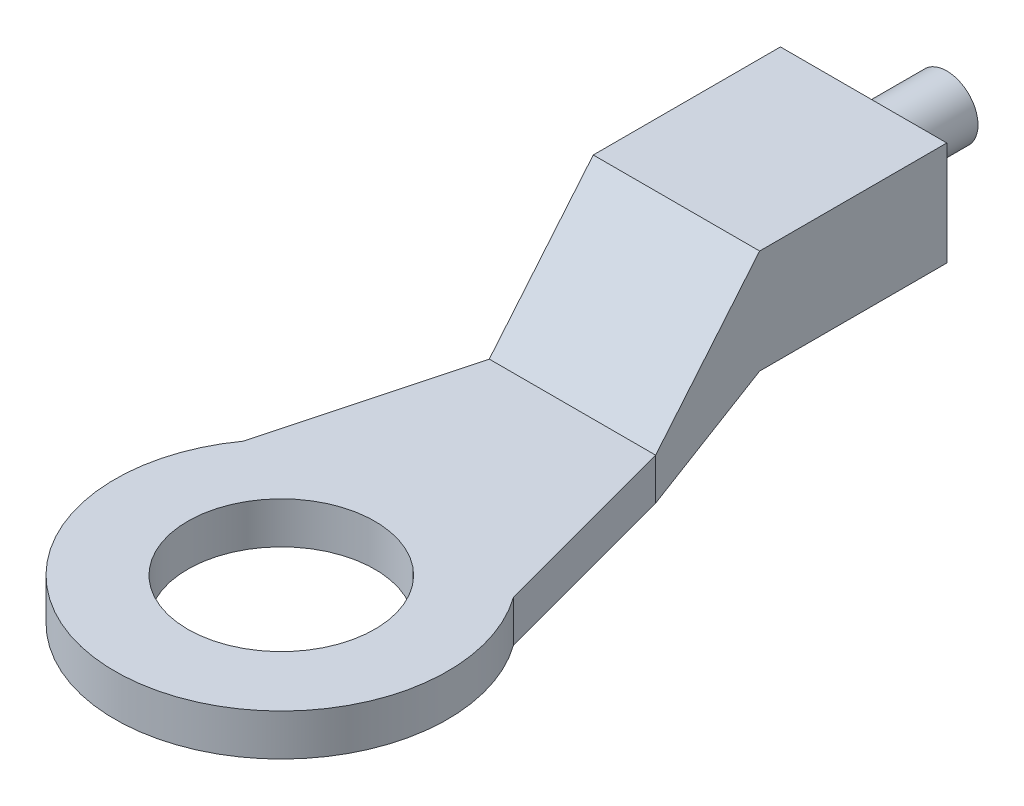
ISO-10303-21;
HEADER;
FILE_DESCRIPTION(('STEP AP214'),'2;1');
FILE_NAME('part.step','',(''),(''),'','','');
FILE_SCHEMA(('AUTOMOTIVE_DESIGN { 1 0 10303 214 1 1 1 1 }'));
ENDSEC;
DATA;
#1=APPLICATION_CONTEXT('core data for automotive mechanical design processes');
#2=APPLICATION_PROTOCOL_DEFINITION('international standard','automotive_design',2000,#1);
#3=PRODUCT_CONTEXT('',#1,'mechanical');
#4=PRODUCT('Part','Part','',(#3));
#5=PRODUCT_RELATED_PRODUCT_CATEGORY('part','',(#4));
#6=PRODUCT_DEFINITION_FORMATION('','',#4);
#7=PRODUCT_DEFINITION_CONTEXT('part definition',#1,'design');
#8=PRODUCT_DEFINITION('design','',#6,#7);
#9=PRODUCT_DEFINITION_SHAPE('','',#8);
#10=(LENGTH_UNIT() NAMED_UNIT(*) SI_UNIT(.MILLI.,.METRE.));
#11=(NAMED_UNIT(*) PLANE_ANGLE_UNIT() SI_UNIT($,.RADIAN.));
#12=(NAMED_UNIT(*) SI_UNIT($,.STERADIAN.) SOLID_ANGLE_UNIT());
#13=UNCERTAINTY_MEASURE_WITH_UNIT(LENGTH_MEASURE(1.E-05),#10,'distance_accuracy_value','');
#14=(GEOMETRIC_REPRESENTATION_CONTEXT(3) GLOBAL_UNCERTAINTY_ASSIGNED_CONTEXT((#13)) GLOBAL_UNIT_ASSIGNED_CONTEXT((#10,
#11,#12)) REPRESENTATION_CONTEXT('',''));
#15=CARTESIAN_POINT('',(0.,0.,0.));
#16=DIRECTION('',(0.,0.,1.));
#17=DIRECTION('',(1.,0.,0.));
#18=AXIS2_PLACEMENT_3D('',#15,#16,#17);
#19=CARTESIAN_POINT('',(2.,4.,-14.));
#20=DIRECTION('',(0.,0.,1.));
#21=DIRECTION('',(1.,0.,0.));
#22=AXIS2_PLACEMENT_3D('',#19,#20,#21);
#23=PLANE('',#22);
#24=DIRECTION('',(-1.,0.,0.));
#25=VECTOR('',#24,1.);
#26=CARTESIAN_POINT('',(2.,1.5,-14.));
#27=LINE('',#26,#25);
#28=CARTESIAN_POINT('',(2.,1.5,-14.));
#29=VERTEX_POINT('',#28);
#30=CARTESIAN_POINT('',(-2.,1.5,-14.));
#31=VERTEX_POINT('',#30);
#32=EDGE_CURVE('E103',#29,#31,#27,.T.);
#33=ORIENTED_EDGE('',*,*,#32,.T.);
#34=DIRECTION('',(0.,1.,0.));
#35=VECTOR('',#34,1.);
#36=CARTESIAN_POINT('',(-2.,4.,-14.));
#37=LINE('',#36,#35);
#38=CARTESIAN_POINT('',(-2.,4.,-14.));
#39=VERTEX_POINT('',#38);
#40=EDGE_CURVE('E113',#31,#39,#37,.T.);
#41=ORIENTED_EDGE('',*,*,#40,.T.);
#42=DIRECTION('',(-1.,0.,0.));
#43=VECTOR('',#42,1.);
#44=CARTESIAN_POINT('',(2.,4.,-14.));
#45=LINE('',#44,#43);
#46=CARTESIAN_POINT('',(2.,4.,-14.));
#47=VERTEX_POINT('',#46);
#48=EDGE_CURVE('E142',#47,#39,#45,.T.);
#49=ORIENTED_EDGE('',*,*,#48,.F.);
#50=DIRECTION('',(0.,1.,0.));
#51=VECTOR('',#50,1.);
#52=CARTESIAN_POINT('',(2.,4.,-14.));
#53=LINE('',#52,#51);
#54=EDGE_CURVE('E133',#29,#47,#53,.T.);
#55=ORIENTED_EDGE('',*,*,#54,.F.);
#56=EDGE_LOOP('',(#33,#41,#49,#55));
#57=FACE_BOUND('',#56,.T.);
#58=CARTESIAN_POINT('',(0.,2.75,-14.));
#59=DIRECTION('',(0.,0.,1.));
#60=DIRECTION('',(1.,0.,0.));
#61=AXIS2_PLACEMENT_3D('',#58,#59,#60);
#62=CIRCLE('',#61,0.75);
#63=CARTESIAN_POINT('',(0.75,2.75,-14.));
#64=VERTEX_POINT('',#63);
#65=EDGE_CURVE('E11',#64,#64,#62,.F.);
#66=ORIENTED_EDGE('',*,*,#65,.F.);
#67=EDGE_LOOP('',(#66));
#68=FACE_BOUND('',#67,.T.);
#69=ADVANCED_FACE('F28',(#57,#68),#23,.F.);
#70=CARTESIAN_POINT('',(0.,1.,0.));
#71=DIRECTION('',(0.,1.,0.));
#72=DIRECTION('',(0.,0.,1.));
#73=AXIS2_PLACEMENT_3D('',#70,#71,#72);
#74=PLANE('',#73);
#75=CARTESIAN_POINT('',(0.,1.,0.));
#76=DIRECTION('',(0.,1.,0.));
#77=DIRECTION('',(0.,0.,1.));
#78=AXIS2_PLACEMENT_3D('',#75,#76,#77);
#79=CIRCLE('',#78,4.);
#80=CARTESIAN_POINT('',(-3.25,1.,-2.3318447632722));
#81=VERTEX_POINT('',#80);
#82=CARTESIAN_POINT('',(3.25,1.,-2.3318447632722));
#83=VERTEX_POINT('',#82);
#84=EDGE_CURVE('E159',#81,#83,#79,.T.);
#85=ORIENTED_EDGE('',*,*,#84,.T.);
#86=DIRECTION('',(-0.258659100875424,0.,-0.96596866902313));
#87=VECTOR('',#86,1.);
#88=CARTESIAN_POINT('',(2.,1.,-7.));
#89=LINE('',#88,#87);
#90=CARTESIAN_POINT('',(2.,1.,-7.));
#91=VERTEX_POINT('',#90);
#92=EDGE_CURVE('E161',#83,#91,#89,.T.);
#93=ORIENTED_EDGE('',*,*,#92,.T.);
#94=DIRECTION('',(-1.,0.,0.));
#95=VECTOR('',#94,1.);
#96=CARTESIAN_POINT('',(-2.,1.,-7.));
#97=LINE('',#96,#95);
#98=CARTESIAN_POINT('',(-2.,1.,-7.));
#99=VERTEX_POINT('',#98);
#100=EDGE_CURVE('E48',#91,#99,#97,.T.);
#101=ORIENTED_EDGE('',*,*,#100,.T.);
#102=DIRECTION('',(-0.258659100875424,0.,0.96596866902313));
#103=VECTOR('',#102,1.);
#104=CARTESIAN_POINT('',(-3.25,1.,-2.3318447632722));
#105=LINE('',#104,#103);
#106=EDGE_CURVE('E43',#99,#81,#105,.T.);
#107=ORIENTED_EDGE('',*,*,#106,.T.);
#108=EDGE_LOOP('',(#85,#93,#101,#107));
#109=FACE_BOUND('',#108,.T.);
#110=CARTESIAN_POINT('',(0.,1.,0.));
#111=DIRECTION('',(0.,1.,0.));
#112=DIRECTION('',(0.,0.,1.));
#113=AXIS2_PLACEMENT_3D('',#110,#111,#112);
#114=CIRCLE('',#113,2.25);
#115=CARTESIAN_POINT('',(0.,1.,2.25));
#116=VERTEX_POINT('',#115);
#117=EDGE_CURVE('E147',#116,#116,#114,.T.);
#118=ORIENTED_EDGE('',*,*,#117,.F.);
#119=EDGE_LOOP('',(#118));
#120=FACE_BOUND('',#119,.T.);
#121=ADVANCED_FACE('F210',(#109,#120),#74,.T.);
#122=CARTESIAN_POINT('',(0.,0.,0.));
#123=DIRECTION('',(0.,1.,0.));
#124=DIRECTION('',(0.,0.,1.));
#125=AXIS2_PLACEMENT_3D('',#122,#123,#124);
#126=PLANE('',#125);
#127=CARTESIAN_POINT('',(0.,0.,0.));
#128=DIRECTION('',(0.,1.,0.));
#129=DIRECTION('',(0.,0.,1.));
#130=AXIS2_PLACEMENT_3D('',#127,#128,#129);
#131=CIRCLE('',#130,4.);
#132=CARTESIAN_POINT('',(-3.25,0.,-2.3318447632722));
#133=VERTEX_POINT('',#132);
#134=CARTESIAN_POINT('',(3.25,0.,-2.3318447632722));
#135=VERTEX_POINT('',#134);
#136=EDGE_CURVE('E150',#133,#135,#131,.T.);
#137=ORIENTED_EDGE('',*,*,#136,.F.);
#138=DIRECTION('',(-0.258659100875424,0.,0.96596866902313));
#139=VECTOR('',#138,1.);
#140=CARTESIAN_POINT('',(-3.25,0.,-2.3318447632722));
#141=LINE('',#140,#139);
#142=CARTESIAN_POINT('',(-2.,0.,-7.));
#143=VERTEX_POINT('',#142);
#144=EDGE_CURVE('E157',#143,#133,#141,.T.);
#145=ORIENTED_EDGE('',*,*,#144,.F.);
#146=DIRECTION('',(-1.,0.,0.));
#147=VECTOR('',#146,1.);
#148=CARTESIAN_POINT('',(-2.,0.,-7.));
#149=LINE('',#148,#147);
#150=CARTESIAN_POINT('',(2.,0.,-7.));
#151=VERTEX_POINT('',#150);
#152=EDGE_CURVE('E117',#151,#143,#149,.T.);
#153=ORIENTED_EDGE('',*,*,#152,.F.);
#154=DIRECTION('',(-0.258659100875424,0.,-0.96596866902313));
#155=VECTOR('',#154,1.);
#156=CARTESIAN_POINT('',(2.,0.,-7.));
#157=LINE('',#156,#155);
#158=EDGE_CURVE('E153',#135,#151,#157,.T.);
#159=ORIENTED_EDGE('',*,*,#158,.F.);
#160=EDGE_LOOP('',(#137,#145,#153,#159));
#161=FACE_BOUND('',#160,.T.);
#162=CARTESIAN_POINT('',(0.,0.,0.));
#163=DIRECTION('',(0.,1.,0.));
#164=DIRECTION('',(0.,0.,1.));
#165=AXIS2_PLACEMENT_3D('',#162,#163,#164);
#166=CIRCLE('',#165,2.25);
#167=CARTESIAN_POINT('',(0.,0.,2.25));
#168=VERTEX_POINT('',#167);
#169=EDGE_CURVE('E102',#168,#168,#166,.T.);
#170=ORIENTED_EDGE('',*,*,#169,.T.);
#171=EDGE_LOOP('',(#170));
#172=FACE_BOUND('',#171,.T.);
#173=ADVANCED_FACE('F182',(#161,#172),#126,.F.);
#174=CARTESIAN_POINT('',(0.,1.,0.));
#175=DIRECTION('',(0.,-1.,0.));
#176=DIRECTION('',(0.,0.,-1.));
#177=AXIS2_PLACEMENT_3D('',#174,#175,#176);
#178=CYLINDRICAL_SURFACE('',#177,4.);
#179=ORIENTED_EDGE('',*,*,#136,.T.);
#180=DIRECTION('',(0.,-1.,0.));
#181=VECTOR('',#180,1.);
#182=CARTESIAN_POINT('',(3.25,1.,-2.3318447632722));
#183=LINE('',#182,#181);
#184=EDGE_CURVE('E36',#83,#135,#183,.T.);
#185=ORIENTED_EDGE('',*,*,#184,.F.);
#186=ORIENTED_EDGE('',*,*,#84,.F.);
#187=DIRECTION('',(0.,-1.,0.));
#188=VECTOR('',#187,1.);
#189=CARTESIAN_POINT('',(-3.25,1.,-2.3318447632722));
#190=LINE('',#189,#188);
#191=EDGE_CURVE('E165',#81,#133,#190,.T.);
#192=ORIENTED_EDGE('',*,*,#191,.T.);
#193=EDGE_LOOP('',(#179,#185,#186,#192));
#194=FACE_BOUND('',#193,.T.);
#195=ADVANCED_FACE('F30',(#194),#178,.T.);
#196=CARTESIAN_POINT('',(2.,1.,-7.));
#197=DIRECTION('',(-0.96596866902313,0.,0.258659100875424));
#198=DIRECTION('',(0.258659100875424,0.,0.96596866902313));
#199=AXIS2_PLACEMENT_3D('',#196,#197,#198);
#200=PLANE('',#199);
#201=ORIENTED_EDGE('',*,*,#158,.T.);
#202=DIRECTION('',(0.,-1.,0.));
#203=VECTOR('',#202,1.);
#204=CARTESIAN_POINT('',(2.,1.,-7.));
#205=LINE('',#204,#203);
#206=EDGE_CURVE('E170',#91,#151,#205,.T.);
#207=ORIENTED_EDGE('',*,*,#206,.F.);
#208=ORIENTED_EDGE('',*,*,#92,.F.);
#209=ORIENTED_EDGE('',*,*,#184,.T.);
#210=EDGE_LOOP('',(#201,#207,#208,#209));
#211=FACE_BOUND('',#210,.T.);
#212=ADVANCED_FACE('F175',(#211),#200,.F.);
#213=CARTESIAN_POINT('',(-3.25,1.,-2.3318447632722));
#214=DIRECTION('',(0.96596866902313,0.,0.258659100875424));
#215=DIRECTION('',(0.258659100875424,0.,-0.96596866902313));
#216=AXIS2_PLACEMENT_3D('',#213,#214,#215);
#217=PLANE('',#216);
#218=ORIENTED_EDGE('',*,*,#144,.T.);
#219=ORIENTED_EDGE('',*,*,#191,.F.);
#220=ORIENTED_EDGE('',*,*,#106,.F.);
#221=DIRECTION('',(0.,-1.,0.));
#222=VECTOR('',#221,1.);
#223=CARTESIAN_POINT('',(-2.,1.,-7.));
#224=LINE('',#223,#222);
#225=EDGE_CURVE('E168',#99,#143,#224,.T.);
#226=ORIENTED_EDGE('',*,*,#225,.T.);
#227=EDGE_LOOP('',(#218,#219,#220,#226));
#228=FACE_BOUND('',#227,.T.);
#229=ADVANCED_FACE('F185',(#228),#217,.F.);
#230=CARTESIAN_POINT('',(0.,1.,0.));
#231=DIRECTION('',(0.,-1.,0.));
#232=DIRECTION('',(0.,0.,-1.));
#233=AXIS2_PLACEMENT_3D('',#230,#231,#232);
#234=CYLINDRICAL_SURFACE('',#233,2.25);
#235=ORIENTED_EDGE('',*,*,#117,.T.);
#236=EDGE_LOOP('',(#235));
#237=FACE_BOUND('',#236,.T.);
#238=ORIENTED_EDGE('',*,*,#169,.F.);
#239=EDGE_LOOP('',(#238));
#240=FACE_BOUND('',#239,.T.);
#241=ADVANCED_FACE('F223',(#237,#240),#234,.F.);
#242=CARTESIAN_POINT('',(2.,1.5,-9.5));
#243=DIRECTION('',(0.,0.857492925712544,0.514495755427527));
#244=DIRECTION('',(0.,-0.514495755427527,0.857492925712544));
#245=AXIS2_PLACEMENT_3D('',#242,#243,#244);
#246=PLANE('',#245);
#247=ORIENTED_EDGE('',*,*,#152,.T.);
#248=DIRECTION('',(0.,0.514495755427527,-0.857492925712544));
#249=VECTOR('',#248,1.);
#250=CARTESIAN_POINT('',(-2.,1.5,-9.5));
#251=LINE('',#250,#249);
#252=CARTESIAN_POINT('',(-2.,1.5,-9.5));
#253=VERTEX_POINT('',#252);
#254=EDGE_CURVE('E110',#143,#253,#251,.T.);
#255=ORIENTED_EDGE('',*,*,#254,.T.);
#256=DIRECTION('',(-1.,0.,0.));
#257=VECTOR('',#256,1.);
#258=CARTESIAN_POINT('',(2.,1.5,-9.5));
#259=LINE('',#258,#257);
#260=CARTESIAN_POINT('',(2.,1.5,-9.5));
#261=VERTEX_POINT('',#260);
#262=EDGE_CURVE('E93',#261,#253,#259,.T.);
#263=ORIENTED_EDGE('',*,*,#262,.F.);
#264=DIRECTION('',(0.,0.514495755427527,-0.857492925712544));
#265=VECTOR('',#264,1.);
#266=CARTESIAN_POINT('',(2.,1.5,-9.5));
#267=LINE('',#266,#265);
#268=EDGE_CURVE('E130',#151,#261,#267,.T.);
#269=ORIENTED_EDGE('',*,*,#268,.F.);
#270=EDGE_LOOP('',(#247,#255,#263,#269));
#271=FACE_BOUND('',#270,.T.);
#272=ADVANCED_FACE('F116',(#271),#246,.F.);
#273=CARTESIAN_POINT('',(2.,1.5,-14.));
#274=DIRECTION('',(0.,1.,0.));
#275=DIRECTION('',(0.,0.,1.));
#276=AXIS2_PLACEMENT_3D('',#273,#274,#275);
#277=PLANE('',#276);
#278=ORIENTED_EDGE('',*,*,#262,.T.);
#279=DIRECTION('',(0.,0.,-1.));
#280=VECTOR('',#279,1.);
#281=CARTESIAN_POINT('',(-2.,1.5,-14.));
#282=LINE('',#281,#280);
#283=EDGE_CURVE('E97',#253,#31,#282,.T.);
#284=ORIENTED_EDGE('',*,*,#283,.T.);
#285=ORIENTED_EDGE('',*,*,#32,.F.);
#286=DIRECTION('',(0.,0.,-1.));
#287=VECTOR('',#286,1.);
#288=CARTESIAN_POINT('',(2.,1.5,-14.));
#289=LINE('',#288,#287);
#290=EDGE_CURVE('E98',#261,#29,#289,.T.);
#291=ORIENTED_EDGE('',*,*,#290,.F.);
#292=EDGE_LOOP('',(#278,#284,#285,#291));
#293=FACE_BOUND('',#292,.T.);
#294=ADVANCED_FACE('F95',(#293),#277,.F.);
#295=CARTESIAN_POINT('',(2.,4.,-9.5));
#296=DIRECTION('',(0.,-1.,0.));
#297=DIRECTION('',(0.,0.,-1.));
#298=AXIS2_PLACEMENT_3D('',#295,#296,#297);
#299=PLANE('',#298);
#300=ORIENTED_EDGE('',*,*,#48,.T.);
#301=DIRECTION('',(0.,0.,1.));
#302=VECTOR('',#301,1.);
#303=CARTESIAN_POINT('',(-2.,4.,-9.5));
#304=LINE('',#303,#302);
#305=CARTESIAN_POINT('',(-2.,4.,-9.5));
#306=VERTEX_POINT('',#305);
#307=EDGE_CURVE('E124',#39,#306,#304,.T.);
#308=ORIENTED_EDGE('',*,*,#307,.T.);
#309=DIRECTION('',(-1.,0.,0.));
#310=VECTOR('',#309,1.);
#311=CARTESIAN_POINT('',(2.,4.,-9.5));
#312=LINE('',#311,#310);
#313=CARTESIAN_POINT('',(2.,4.,-9.5));
#314=VERTEX_POINT('',#313);
#315=EDGE_CURVE('E140',#314,#306,#312,.T.);
#316=ORIENTED_EDGE('',*,*,#315,.F.);
#317=DIRECTION('',(0.,0.,1.));
#318=VECTOR('',#317,1.);
#319=CARTESIAN_POINT('',(2.,4.,-9.5));
#320=LINE('',#319,#318);
#321=EDGE_CURVE('E135',#47,#314,#320,.T.);
#322=ORIENTED_EDGE('',*,*,#321,.F.);
#323=EDGE_LOOP('',(#300,#308,#316,#322));
#324=FACE_BOUND('',#323,.T.);
#325=ADVANCED_FACE('F193',(#324),#299,.F.);
#326=CARTESIAN_POINT('',(2.,1.,-7.));
#327=DIRECTION('',(0.,-0.64018439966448,-0.768221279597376));
#328=DIRECTION('',(0.,0.768221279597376,-0.64018439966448));
#329=AXIS2_PLACEMENT_3D('',#326,#327,#328);
#330=PLANE('',#329);
#331=ORIENTED_EDGE('',*,*,#315,.T.);
#332=DIRECTION('',(0.,-0.768221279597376,0.64018439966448));
#333=VECTOR('',#332,1.);
#334=CARTESIAN_POINT('',(-2.,1.,-7.));
#335=LINE('',#334,#333);
#336=EDGE_CURVE('E127',#306,#99,#335,.T.);
#337=ORIENTED_EDGE('',*,*,#336,.T.);
#338=ORIENTED_EDGE('',*,*,#100,.F.);
#339=DIRECTION('',(0.,-0.768221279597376,0.64018439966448));
#340=VECTOR('',#339,1.);
#341=CARTESIAN_POINT('',(2.,1.,-7.));
#342=LINE('',#341,#340);
#343=EDGE_CURVE('E137',#314,#91,#342,.T.);
#344=ORIENTED_EDGE('',*,*,#343,.F.);
#345=EDGE_LOOP('',(#331,#337,#338,#344));
#346=FACE_BOUND('',#345,.T.);
#347=ADVANCED_FACE('F188',(#346),#330,.F.);
#348=CARTESIAN_POINT('',(2.,1.5,-7.));
#349=DIRECTION('',(-1.,0.,0.));
#350=DIRECTION('',(0.,0.,1.));
#351=AXIS2_PLACEMENT_3D('',#348,#349,#350);
#352=PLANE('',#351);
#353=ORIENTED_EDGE('',*,*,#206,.T.);
#354=ORIENTED_EDGE('',*,*,#268,.T.);
#355=ORIENTED_EDGE('',*,*,#290,.T.);
#356=ORIENTED_EDGE('',*,*,#54,.T.);
#357=ORIENTED_EDGE('',*,*,#321,.T.);
#358=ORIENTED_EDGE('',*,*,#343,.T.);
#359=EDGE_LOOP('',(#353,#354,#355,#356,#357,#358));
#360=FACE_BOUND('',#359,.T.);
#361=ADVANCED_FACE('F199',(#360),#352,.F.);
#362=CARTESIAN_POINT('',(-2.,1.5,-7.));
#363=DIRECTION('',(-1.,0.,0.));
#364=DIRECTION('',(0.,0.,1.));
#365=AXIS2_PLACEMENT_3D('',#362,#363,#364);
#366=PLANE('',#365);
#367=ORIENTED_EDGE('',*,*,#225,.F.);
#368=ORIENTED_EDGE('',*,*,#336,.F.);
#369=ORIENTED_EDGE('',*,*,#307,.F.);
#370=ORIENTED_EDGE('',*,*,#40,.F.);
#371=ORIENTED_EDGE('',*,*,#283,.F.);
#372=ORIENTED_EDGE('',*,*,#254,.F.);
#373=EDGE_LOOP('',(#367,#368,#369,#370,#371,#372));
#374=FACE_BOUND('',#373,.T.);
#375=ADVANCED_FACE('F109',(#374),#366,.T.);
#376=CARTESIAN_POINT('',(0.,2.75,-16.));
#377=DIRECTION('',(0.,0.,1.));
#378=DIRECTION('',(1.,0.,0.));
#379=AXIS2_PLACEMENT_3D('',#376,#377,#378);
#380=CYLINDRICAL_SURFACE('',#379,0.75);
#381=CARTESIAN_POINT('',(0.,2.75,-16.));
#382=DIRECTION('',(0.,0.,-1.));
#383=DIRECTION('',(-1.,0.,0.));
#384=AXIS2_PLACEMENT_3D('',#381,#382,#383);
#385=CIRCLE('',#384,0.75);
#386=CARTESIAN_POINT('',(-0.75,2.75,-16.));
#387=VERTEX_POINT('',#386);
#388=EDGE_CURVE('E118',#387,#387,#385,.T.);
#389=ORIENTED_EDGE('',*,*,#388,.F.);
#390=EDGE_LOOP('',(#389));
#391=FACE_BOUND('',#390,.T.);
#392=ORIENTED_EDGE('',*,*,#65,.T.);
#393=EDGE_LOOP('',(#392));
#394=FACE_BOUND('',#393,.T.);
#395=ADVANCED_FACE('F206',(#391,#394),#380,.T.);
#396=CARTESIAN_POINT('',(0.,2.75,-16.));
#397=DIRECTION('',(0.,0.,-1.));
#398=DIRECTION('',(-1.,0.,0.));
#399=AXIS2_PLACEMENT_3D('',#396,#397,#398);
#400=PLANE('',#399);
#401=ORIENTED_EDGE('',*,*,#388,.T.);
#402=EDGE_LOOP('',(#401));
#403=FACE_BOUND('',#402,.T.);
#404=ADVANCED_FACE('F282',(#403),#400,.T.);
#405=CLOSED_SHELL('',(#69,#121,#173,#195,#212,#229,#241,#272,#294,#325,#347,#361,#375,#395,#404));
#406=MANIFOLD_SOLID_BREP('B2',#405);
#407=ADVANCED_BREP_SHAPE_REPRESENTATION('',(#18,#406),#14);
#408=SHAPE_DEFINITION_REPRESENTATION(#9,#407);
ENDSEC;
END-ISO-10303-21;
